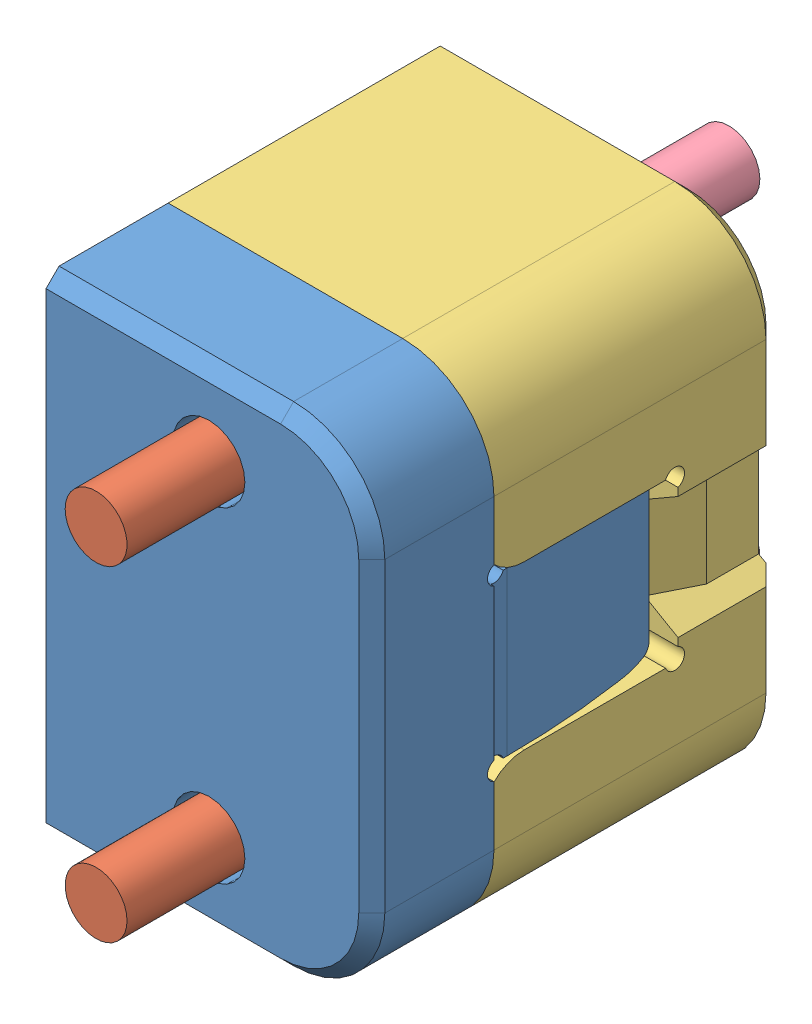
SolidWorks assembly TL100X150.SLDASM, configuration Default (file format 10000). Lengths in mm.
Overall size (25.4 38.1 49.34).
8 component instances, 4 part files, 6 mates.
Components (placement in the parent):
- TL100X150 MALE HALF-1: TL100X150 MALE HALF.sldasm [Default] at origin size (25.4 38.1 31.86)
  - TL100X150 MALE-1: TL100X150 MALE.SLDPRT [Default] at (12.7 0 0) size (25.4 38.1 23.06)
  - SHCS10-32L.50-1: SHCS10-32L.50.sldprt [SHCS10-32L.50] at (12.7 -12.7 5.6197) size (7.92 7.92 17.53)
  - SHCS10-32L.50-2: SHCS10-32L.50.sldprt [SHCS10-32L.50] at (12.7 12.7 5.6197) x (-1 0 0) z (0 0 1) size (7.92 7.92 17.53)
- TL100X150 FEMALE HALF-1: TL100X150 FEMALE HALF.sldasm [Default] at origin size (25.4 38.1 31.02)
  - TL100X150 FEMALE-1: TL100X150 FEMALE.sldprt [Default] at (12.7 0 0) x (-1 0 0) z (0 0 1) size (25.4 38.1 22.23)
  - SHCS10-32L1.00-1: SHCS10-32L1.00.sldprt [SHCS10-32L1.00] at (12.7 12.7 -5.6197) x (-0.923728 -0.383049 0) z (0 0 -1) size (7.92 7.92 30.23)
  - SHCS10-32L1.00-2: SHCS10-32L1.00.sldprt [SHCS10-32L1.00] at (12.7 -12.7 -5.6197) x (0.923728 -0.383049 0) z (0 0 -1) size (7.92 7.92 30.23)
Mates (geometry in assembly coordinates):
- Coincident1: coincident aligned: plane of TL100X150 MALE HALF-1 through (0 0 0) normal (0 0 1); plane of assembly through (0 0 0) normal (0 0 1)
- Coincident2: coincident aligned: plane of TL100X150 MALE HALF-1 through (0 0 0) normal (0 1 0); plane of assembly through (0 0 0) normal (0 1 0)
- Coincident3: coincident aligned: plane of TL100X150 MALE HALF-1 through (0 0 0) normal (1 0 0); plane of assembly through (0 0 0) normal (1 0 0)
- Coincident4: coincident aligned: plane of TL100X150 FEMALE HALF-1 through (0 0 0) normal (0 0 1); plane of assembly through (0 0 0) normal (0 0 1)
- Coincident5: coincident aligned: plane of TL100X150 FEMALE HALF-1 through (0 0 0) normal (0 1 0); plane of assembly through (0 0 0) normal (0 1 0)
- Coincident6: coincident aligned: plane of TL100X150 FEMALE HALF-1 through (0 0 0) normal (1 0 0); plane of assembly through (0 0 0) normal (1 0 0)
